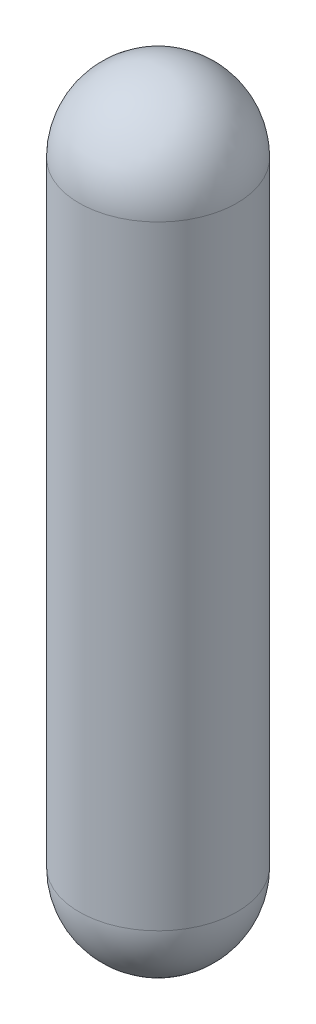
ISO-10303-21;
HEADER;
FILE_DESCRIPTION(('STEP AP214'),'2;1');
FILE_NAME('part.step','',(''),(''),'','','');
FILE_SCHEMA(('AUTOMOTIVE_DESIGN { 1 0 10303 214 1 1 1 1 }'));
ENDSEC;
DATA;
#1=APPLICATION_CONTEXT('core data for automotive mechanical design processes');
#2=APPLICATION_PROTOCOL_DEFINITION('international standard','automotive_design',2000,#1);
#3=PRODUCT_CONTEXT('',#1,'mechanical');
#4=PRODUCT('Part','Part','',(#3));
#5=PRODUCT_RELATED_PRODUCT_CATEGORY('part','',(#4));
#6=PRODUCT_DEFINITION_FORMATION('','',#4);
#7=PRODUCT_DEFINITION_CONTEXT('part definition',#1,'design');
#8=PRODUCT_DEFINITION('design','',#6,#7);
#9=PRODUCT_DEFINITION_SHAPE('','',#8);
#10=(LENGTH_UNIT() NAMED_UNIT(*) SI_UNIT(.MILLI.,.METRE.));
#11=(NAMED_UNIT(*) PLANE_ANGLE_UNIT() SI_UNIT($,.RADIAN.));
#12=(NAMED_UNIT(*) SI_UNIT($,.STERADIAN.) SOLID_ANGLE_UNIT());
#13=UNCERTAINTY_MEASURE_WITH_UNIT(LENGTH_MEASURE(1.E-05),#10,'distance_accuracy_value','');
#14=(GEOMETRIC_REPRESENTATION_CONTEXT(3) GLOBAL_UNCERTAINTY_ASSIGNED_CONTEXT((#13)) GLOBAL_UNIT_ASSIGNED_CONTEXT((#10,
#11,#12)) REPRESENTATION_CONTEXT('',''));
#15=CARTESIAN_POINT('',(0.,0.,0.));
#16=DIRECTION('',(0.,0.,1.));
#17=DIRECTION('',(1.,0.,0.));
#18=AXIS2_PLACEMENT_3D('',#15,#16,#17);
#19=CARTESIAN_POINT('',(0.,558.8,0.));
#20=DIRECTION('',(0.,-1.,0.));
#21=DIRECTION('',(0.,0.,-1.));
#22=AXIS2_PLACEMENT_3D('',#19,#20,#21);
#23=CYLINDRICAL_SURFACE('',#22,57.15);
#24=CARTESIAN_POINT('',(0.,501.65,0.));
#25=DIRECTION('',(0.,-1.,0.));
#26=DIRECTION('',(0.,0.,-1.));
#27=AXIS2_PLACEMENT_3D('',#24,#25,#26);
#28=CIRCLE('',#27,57.15);
#29=CARTESIAN_POINT('',(0.,501.65,-57.15));
#30=VERTEX_POINT('',#29);
#31=EDGE_CURVE('E10',#30,#30,#28,.T.);
#32=ORIENTED_EDGE('',*,*,#31,.T.);
#33=EDGE_LOOP('',(#32));
#34=FACE_BOUND('',#33,.T.);
#35=CARTESIAN_POINT('',(0.,57.15,0.));
#36=DIRECTION('',(0.,-1.,0.));
#37=DIRECTION('',(0.,0.,-1.));
#38=AXIS2_PLACEMENT_3D('',#35,#36,#37);
#39=CIRCLE('',#38,57.15);
#40=CARTESIAN_POINT('',(0.,57.15,-57.15));
#41=VERTEX_POINT('',#40);
#42=EDGE_CURVE('E38',#41,#41,#39,.F.);
#43=ORIENTED_EDGE('',*,*,#42,.T.);
#44=EDGE_LOOP('',(#43));
#45=FACE_BOUND('',#44,.T.);
#46=ADVANCED_FACE('F31',(#34,#45),#23,.T.);
#47=CARTESIAN_POINT('',(0.,501.65,0.));
#48=DIRECTION('',(0.,0.,1.));
#49=DIRECTION('',(1.,0.,0.));
#50=AXIS2_PLACEMENT_3D('',#47,#48,#49);
#51=SPHERICAL_SURFACE('',#50,57.15);
#52=CARTESIAN_POINT('',(0.,501.65,0.));
#53=DIRECTION('',(0.,-1.,0.));
#54=DIRECTION('',(0.,0.,-1.));
#55=AXIS2_PLACEMENT_3D('',#52,#53,#54);
#56=SPHERICAL_SURFACE('',#55,57.15);
#57=ORIENTED_EDGE('',*,*,#31,.F.);
#58=EDGE_LOOP('',(#57));
#59=FACE_BOUND('',#58,.T.);
#60=ADVANCED_FACE('F46',(#59),#56,.T.);
#61=CARTESIAN_POINT('',(0.,57.15,0.));
#62=DIRECTION('',(0.,0.,1.));
#63=DIRECTION('',(1.,0.,0.));
#64=AXIS2_PLACEMENT_3D('',#61,#62,#63);
#65=SPHERICAL_SURFACE('',#64,57.15);
#66=CARTESIAN_POINT('',(0.,57.15,0.));
#67=DIRECTION('',(0.,-1.,0.));
#68=DIRECTION('',(0.,0.,-1.));
#69=AXIS2_PLACEMENT_3D('',#66,#67,#68);
#70=SPHERICAL_SURFACE('',#69,57.15);
#71=ORIENTED_EDGE('',*,*,#42,.F.);
#72=EDGE_LOOP('',(#71));
#73=FACE_BOUND('',#72,.T.);
#74=ADVANCED_FACE('F33',(#73),#70,.T.);
#75=CLOSED_SHELL('',(#46,#60,#74));
#76=MANIFOLD_SOLID_BREP('B2',#75);
#77=ADVANCED_BREP_SHAPE_REPRESENTATION('',(#18,#76),#14);
#78=SHAPE_DEFINITION_REPRESENTATION(#9,#77);
ENDSEC;
END-ISO-10303-21;
